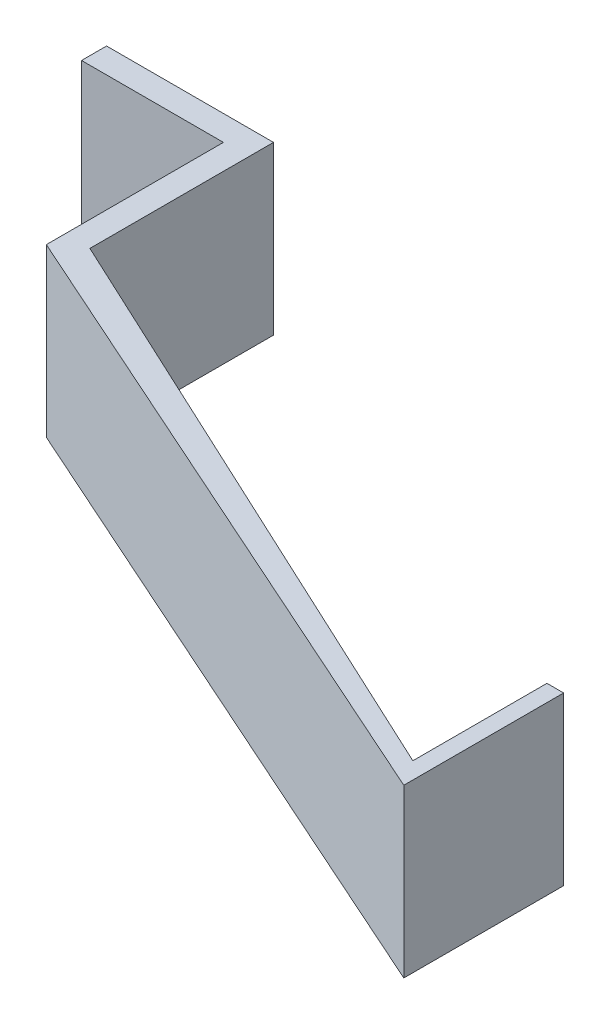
from build123d import *

# Parameters (mm, degrees)
BOSS_EXTRUDE2_DEPTH = 20


with BuildPart() as part:
    # Sketch1 → Boss-Extrude2 (new body)
    with BuildSketch(Plane(origin=(0, 0, 0), x_dir=(1, 0, 0), z_dir=(0, 1, 0))):
        Polygon((0, 0), (0, 22), (-20, 22), (-20, 19), (-3, 19), (-3, -2.214143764), (74.504622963, -36.89551427), (74.504622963, -25.449476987), (74.504622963, -17.74527175), (72.504622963, -17.74527175), (72.504622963, -33.809460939), align=None)
    extrude(amount=BOSS_EXTRUDE2_DEPTH)


solid = part.part
